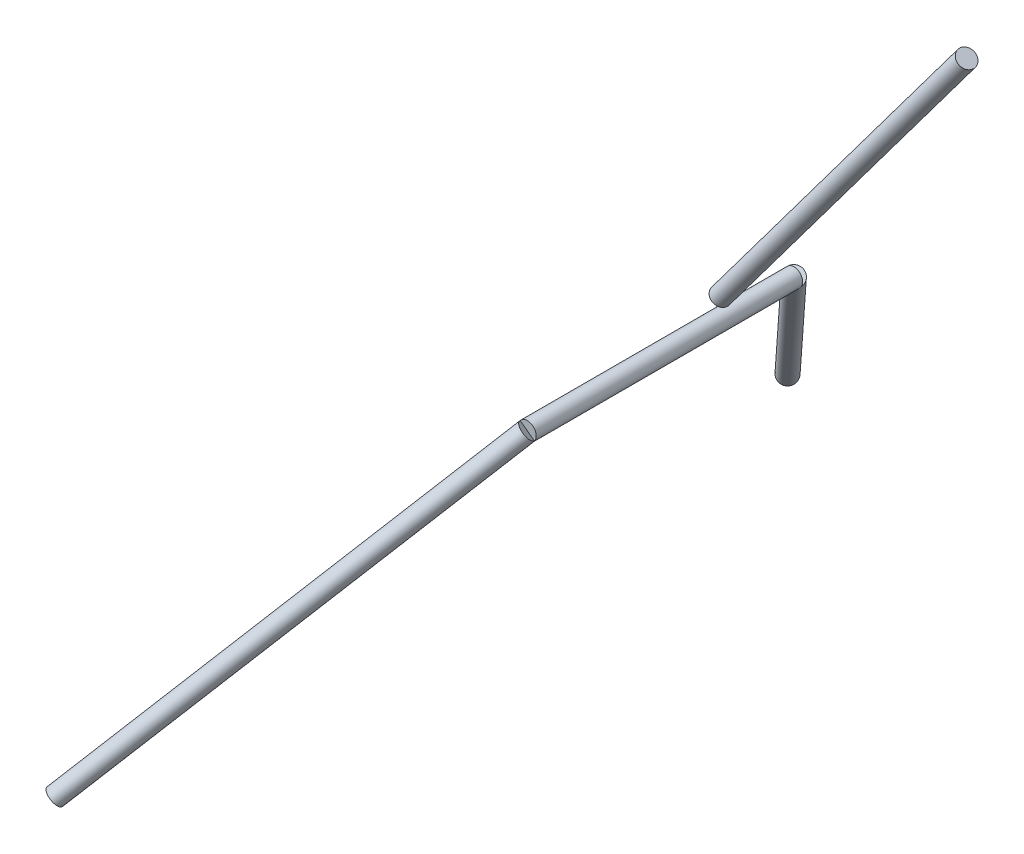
from build123d import *

# Parameters (mm, degrees)
CABLE_PUENTE_1_PROFILE_R = 0.8
CABLE_PUENTE_2_PROFILE_R = 0.8
CABLE_PUENTE_3_PROFILE_R = 0.8
CABLE_TIRO_PROFILE_R     = 0.8


with BuildPart() as part:
    # Cable_puente_1: sweep along a curve in space
    with BuildLine() as cable_puente_1_path:
        Line((-219.39211406, 374.952663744, -33), (-197.823554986, 403.776217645, -12))
    # Cable_puente_1 profile (on start of the path) → Cable_puente_1 (sweep)
    with BuildSketch(Plane(origin=(-219.39211406, 374.952663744, -33), x_dir=(0.8006542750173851, -0.5991266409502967, 0), z_dir=(0.5175129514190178, 0.691588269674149, 0.5038710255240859))):
        Circle(CABLE_PUENTE_1_PROFILE_R)
    sweep(path=cable_puente_1_path.line)

    # Cable_puente_2: sweep along a curve in space
    with BuildLine() as cable_puente_2_path:
        Line((-197.823554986, 403.776217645, -12), (-197.823554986, 403.776217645, 12))
    # Cable_puente_2 profile (on start of the path) → Cable_puente_2 (sweep)
    with BuildSketch(Plane(origin=(-197.823554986, 403.776217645, -12), x_dir=(1, 0, 0), z_dir=(0, 0, 1))):
        Circle(CABLE_PUENTE_2_PROFILE_R)
    sweep(path=cable_puente_2_path.line)

    # Cable_puente_3: sweep along a curve in space
    with BuildLine() as cable_puente_3_path:
        Line((-197.823554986, 403.776217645, 12), (-219.39211406, 374.952663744, 33))
    # Cable_puente_3 profile (on start of the path) → Cable_puente_3 (sweep)
    with BuildSketch(Plane(origin=(-197.823554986, 403.776217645, 12), x_dir=(-0.8006542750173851, 0.5991266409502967, 0), z_dir=(-0.5175129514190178, -0.691588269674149, 0.5038710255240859))):
        Circle(CABLE_PUENTE_3_PROFILE_R)
    sweep(path=cable_puente_3_path.line)


with BuildPart() as body_2:
    # Cable_tiro: sweep along a curve in space
    with BuildLine() as cable_tiro_path:
        Line((-192.431415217, 410.98210612, 0), (-170.263729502, 440.606314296, 0))
    # Cable_tiro profile (on start of the path) → Cable_tiro (sweep)
    with BuildSketch(Plane(origin=(-192.431415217, 410.98210612, 0), x_dir=(0.8006542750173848, -0.599126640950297, 0), z_dir=(0.599126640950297, 0.8006542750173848, 0))):
        Circle(CABLE_TIRO_PROFILE_R)
    sweep(path=cable_tiro_path.line)


solid = Compound([part.part, body_2.part])
